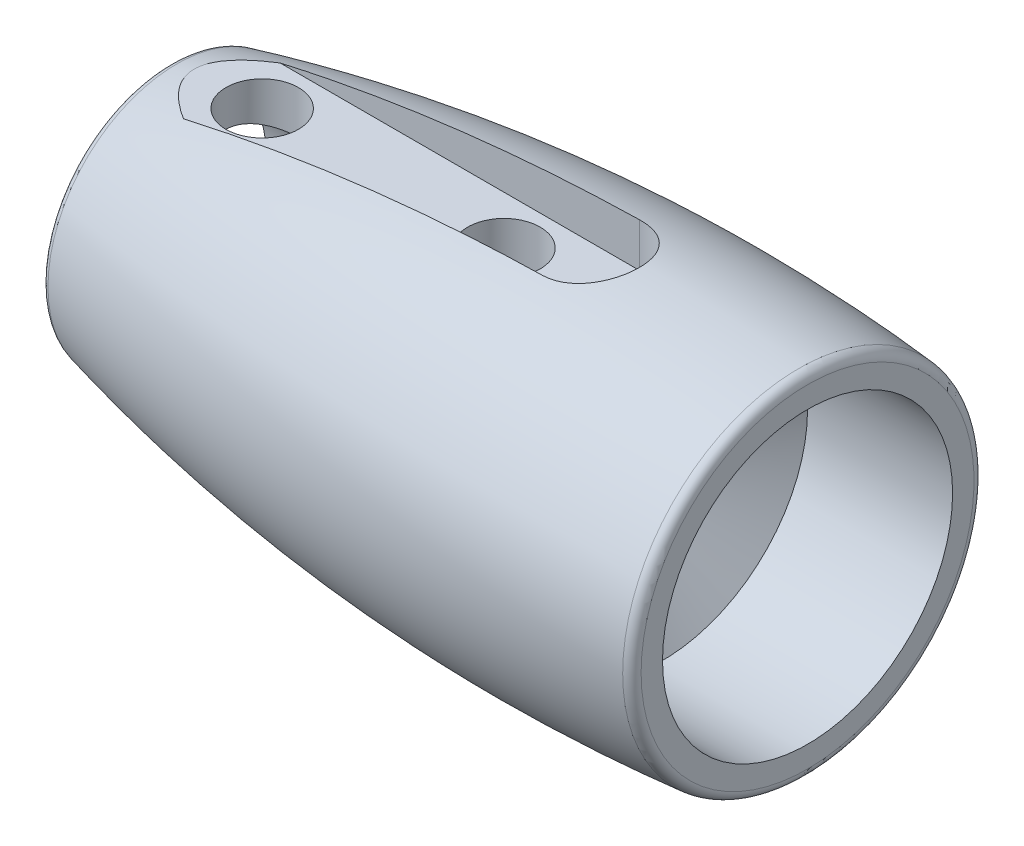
from build123d import *

# Parameters (mm, degrees)
ENL_V_MAT_EXTRU_1_DEPTH             = 47.009270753
DIAM_TRE_DU_PER_AGE_3_7_3_7_2_D     = 3.75
DIAM_TRE_DU_PER_AGE_3_7_3_7_2_DEPTH = 6
DIAM_TRE_DU_PER_AGE_3_7_3_7_2_TIP   = 1.126613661
CONG_3_R                            = 0.5
DIAM_TRE_DU_PER_AGE_15_0_15_1_D     = 15
DIAM_TRE_DU_PER_AGE_15_0_15_1_DEPTH = 7.5
DIAM_TRE_DU_PER_AGE_15_0_15_1_TIP   = 4.506454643


with BuildPart() as part:
    # Esquisse1 → R_volution1 (revolve)
    with BuildSketch(Plane.XY, mode=Mode.PRIVATE) as r_volution1_sk:
        with BuildLine():
            Line((8.933417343, 6.5625), (8.933417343, 5))
            Line((8.933417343, 5), (41.933417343, 5))
            Line((41.933417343, 5), (41.933417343, 9.0625))
            ThreePointArc((41.933417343, 9.0625), (25.32661609, 9.222276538), (8.933417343, 6.5625))
        make_face()
    revolve(r_volution1_sk.sketch.rotate(Axis((0, 0, 0), (1, 0, 0)), 90), axis=Axis((0, 0, 0), (1, 0, 0)))

    # Esquisse7 → Enl_v. mat.-Extru.1 (cut, through all)
    with BuildSketch(Plane(origin=(0, 6.875, 0), x_dir=(-1, 0, 0), z_dir=(0, 1, 0))):
        with BuildLine():
            Line((-30.733417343, 2.5), (-5.733417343, 2.5))
            ThreePointArc((-5.733417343, 2.5), (-3.233417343, 0), (-5.733417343, -2.5))
            Line((-5.733417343, -2.5), (-30.733417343, -2.5))
            ThreePointArc((-30.733417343, -2.5), (-33.233417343, 0), (-30.733417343, 2.5))
        make_face()
    extrude(amount=ENL_V_MAT_EXTRU_1_DEPTH, mode=Mode.SUBTRACT)

    # Diam_tre du per_age _3.7 _3.7_2
    with Locations(Plane(origin=(0, 6.875, 0), x_dir=(-1, 0, 0), z_dir=(0, 1, 0))):
        with Locations((-26.233417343, 0), (-13.733417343, 0)):
            Hole(DIAM_TRE_DU_PER_AGE_3_7_3_7_2_D / 2, depth=DIAM_TRE_DU_PER_AGE_3_7_3_7_2_DEPTH)
            with Locations((0, 0, -(DIAM_TRE_DU_PER_AGE_3_7_3_7_2_DEPTH + DIAM_TRE_DU_PER_AGE_3_7_3_7_2_TIP / 2))):  # 118° drill point
                Cone(0, DIAM_TRE_DU_PER_AGE_3_7_3_7_2_D / 2, DIAM_TRE_DU_PER_AGE_3_7_3_7_2_TIP, mode=Mode.SUBTRACT)

    # Cong_3
    cong_3_edges = [part.edges().sort_by_distance(p)[0] for p in [
        (41.933417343, 0, -9.0625),
        (8.933417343, 0, -6.5625),
    ]]
    fillet(cong_3_edges, radius=CONG_3_R)

    # Diam_tre du per_age _15.0 _15_1
    with Locations(Plane(origin=(41.933417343, 0, 0), x_dir=(0, 0, -1), z_dir=(1, 0, 0))):
        with Locations((0, 0)):
            Hole(DIAM_TRE_DU_PER_AGE_15_0_15_1_D / 2, depth=DIAM_TRE_DU_PER_AGE_15_0_15_1_DEPTH)
            with Locations((0, 0, -(DIAM_TRE_DU_PER_AGE_15_0_15_1_DEPTH + DIAM_TRE_DU_PER_AGE_15_0_15_1_TIP / 2))):  # 118° drill point
                Cone(0, DIAM_TRE_DU_PER_AGE_15_0_15_1_D / 2, DIAM_TRE_DU_PER_AGE_15_0_15_1_TIP, mode=Mode.SUBTRACT)


solid = part.part
